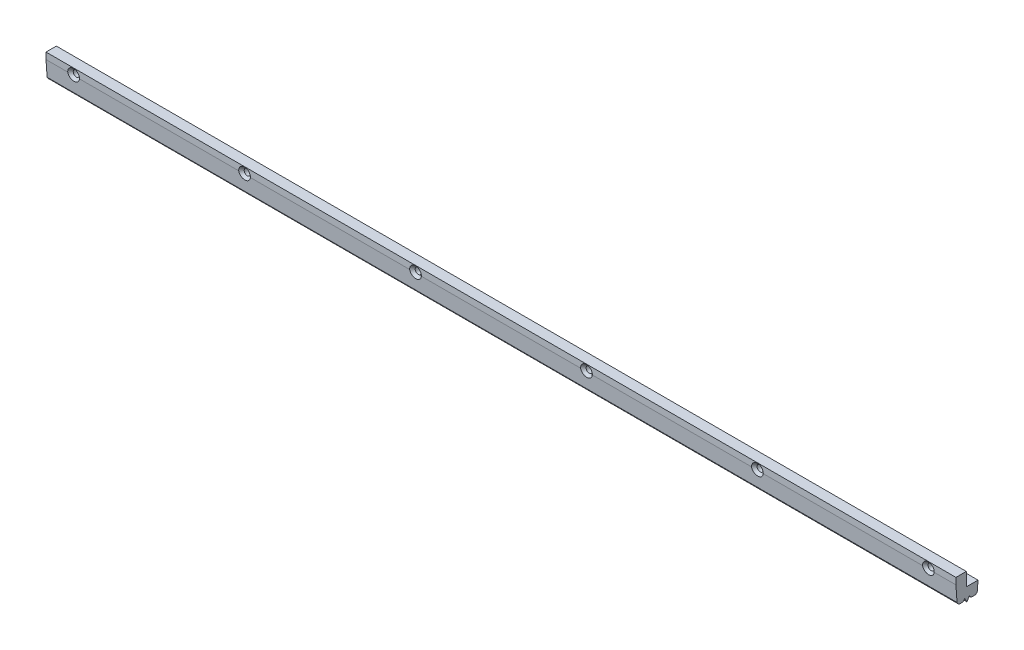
ISO-10303-21;
HEADER;
FILE_DESCRIPTION(('STEP AP214'),'2;1');
FILE_NAME('part.step','',(''),(''),'','','');
FILE_SCHEMA(('AUTOMOTIVE_DESIGN { 1 0 10303 214 1 1 1 1 }'));
ENDSEC;
DATA;
#1=APPLICATION_CONTEXT('core data for automotive mechanical design processes');
#2=APPLICATION_PROTOCOL_DEFINITION('international standard','automotive_design',2000,#1);
#3=PRODUCT_CONTEXT('',#1,'mechanical');
#4=PRODUCT('Part','Part','',(#3));
#5=PRODUCT_RELATED_PRODUCT_CATEGORY('part','',(#4));
#6=PRODUCT_DEFINITION_FORMATION('','',#4);
#7=PRODUCT_DEFINITION_CONTEXT('part definition',#1,'design');
#8=PRODUCT_DEFINITION('design','',#6,#7);
#9=PRODUCT_DEFINITION_SHAPE('','',#8);
#10=(LENGTH_UNIT() NAMED_UNIT(*) SI_UNIT(.MILLI.,.METRE.));
#11=(NAMED_UNIT(*) PLANE_ANGLE_UNIT() SI_UNIT($,.RADIAN.));
#12=(NAMED_UNIT(*) SI_UNIT($,.STERADIAN.) SOLID_ANGLE_UNIT());
#13=UNCERTAINTY_MEASURE_WITH_UNIT(LENGTH_MEASURE(1.E-05),#10,'distance_accuracy_value','');
#14=(GEOMETRIC_REPRESENTATION_CONTEXT(3) GLOBAL_UNCERTAINTY_ASSIGNED_CONTEXT((#13)) GLOBAL_UNIT_ASSIGNED_CONTEXT((#10,
#11,#12)) REPRESENTATION_CONTEXT('',''));
#15=CARTESIAN_POINT('',(0.,0.,0.));
#16=DIRECTION('',(0.,0.,1.));
#17=DIRECTION('',(1.,0.,0.));
#18=AXIS2_PLACEMENT_3D('',#15,#16,#17);
#19=CARTESIAN_POINT('',(330.,0.,0.));
#20=DIRECTION('',(0.,0.5,-0.866025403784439));
#21=DIRECTION('',(0.,0.866025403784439,0.5));
#22=AXIS2_PLACEMENT_3D('',#19,#20,#21);
#23=PLANE('',#22);
#24=DIRECTION('',(0.,-0.866025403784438,-0.5));
#25=VECTOR('',#24,1.);
#26=CARTESIAN_POINT('',(-330.,0.,0.));
#27=LINE('',#26,#25);
#28=CARTESIAN_POINT('',(-330.,3.03108891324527,1.74999999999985));
#29=VERTEX_POINT('',#28);
#30=CARTESIAN_POINT('',(-330.,0.,0.));
#31=VERTEX_POINT('',#30);
#32=EDGE_CURVE('E265',#29,#31,#27,.T.);
#33=ORIENTED_EDGE('',*,*,#32,.T.);
#34=DIRECTION('',(-1.,0.,0.));
#35=VECTOR('',#34,1.);
#36=CARTESIAN_POINT('',(330.,0.,0.));
#37=LINE('',#36,#35);
#38=CARTESIAN_POINT('',(330.,0.,0.));
#39=VERTEX_POINT('',#38);
#40=EDGE_CURVE('E252',#39,#31,#37,.T.);
#41=ORIENTED_EDGE('',*,*,#40,.F.);
#42=DIRECTION('',(0.,-0.866025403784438,-0.5));
#43=VECTOR('',#42,1.);
#44=CARTESIAN_POINT('',(330.,0.,0.));
#45=LINE('',#44,#43);
#46=CARTESIAN_POINT('',(330.,3.03108891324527,1.74999999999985));
#47=VERTEX_POINT('',#46);
#48=EDGE_CURVE('E381',#47,#39,#45,.T.);
#49=ORIENTED_EDGE('',*,*,#48,.F.);
#50=DIRECTION('',(-1.,0.,0.));
#51=VECTOR('',#50,1.);
#52=CARTESIAN_POINT('',(330.,3.03108891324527,1.74999999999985));
#53=LINE('',#52,#51);
#54=EDGE_CURVE('E430',#47,#29,#53,.T.);
#55=ORIENTED_EDGE('',*,*,#54,.T.);
#56=EDGE_LOOP('',(#33,#41,#49,#55));
#57=FACE_BOUND('',#56,.T.);
#58=ADVANCED_FACE('F40',(#57),#23,.F.);
#59=CARTESIAN_POINT('',(330.,0.,0.));
#60=DIRECTION('',(0.,0.499999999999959,0.866025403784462));
#61=DIRECTION('',(0.,-0.866025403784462,0.499999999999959));
#62=AXIS2_PLACEMENT_3D('',#59,#60,#61);
#63=PLANE('',#62);
#64=DIRECTION('',(0.,0.866025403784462,-0.499999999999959));
#65=VECTOR('',#64,1.);
#66=CARTESIAN_POINT('',(-330.,0.,0.));
#67=LINE('',#66,#65);
#68=CARTESIAN_POINT('',(-330.,3.03108891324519,-1.74999999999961));
#69=VERTEX_POINT('',#68);
#70=EDGE_CURVE('E339',#31,#69,#67,.T.);
#71=ORIENTED_EDGE('',*,*,#70,.T.);
#72=DIRECTION('',(-1.,0.,0.));
#73=VECTOR('',#72,1.);
#74=CARTESIAN_POINT('',(330.,3.03108891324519,-1.74999999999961));
#75=LINE('',#74,#73);
#76=CARTESIAN_POINT('',(330.,3.03108891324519,-1.74999999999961));
#77=VERTEX_POINT('',#76);
#78=EDGE_CURVE('E248',#77,#69,#75,.T.);
#79=ORIENTED_EDGE('',*,*,#78,.F.);
#80=DIRECTION('',(0.,0.866025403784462,-0.499999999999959));
#81=VECTOR('',#80,1.);
#82=CARTESIAN_POINT('',(330.,0.,0.));
#83=LINE('',#82,#81);
#84=EDGE_CURVE('E385',#39,#77,#83,.T.);
#85=ORIENTED_EDGE('',*,*,#84,.F.);
#86=ORIENTED_EDGE('',*,*,#40,.T.);
#87=EDGE_LOOP('',(#71,#79,#85,#86));
#88=FACE_BOUND('',#87,.T.);
#89=ADVANCED_FACE('F497',(#88),#63,.F.);
#90=CARTESIAN_POINT('',(330.,3.03108891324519,-1.74999999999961));
#91=DIRECTION('',(0.,0.500000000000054,-0.866025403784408));
#92=DIRECTION('',(0.,0.866025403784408,0.500000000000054));
#93=AXIS2_PLACEMENT_3D('',#90,#91,#92);
#94=PLANE('',#93);
#95=DIRECTION('',(0.,-0.866025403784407,-0.500000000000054));
#96=VECTOR('',#95,1.);
#97=CARTESIAN_POINT('',(-330.,3.03108891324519,-1.74999999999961));
#98=LINE('',#97,#96);
#99=CARTESIAN_POINT('',(-330.,1.89999999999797,-2.40303448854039));
#100=VERTEX_POINT('',#99);
#101=EDGE_CURVE('E342',#69,#100,#98,.T.);
#102=ORIENTED_EDGE('',*,*,#101,.T.);
#103=DIRECTION('',(-1.,0.,0.));
#104=VECTOR('',#103,1.);
#105=CARTESIAN_POINT('',(330.,1.89999999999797,-2.40303448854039));
#106=LINE('',#105,#104);
#107=CARTESIAN_POINT('',(330.,1.89999999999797,-2.40303448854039));
#108=VERTEX_POINT('',#107);
#109=EDGE_CURVE('E244',#108,#100,#106,.T.);
#110=ORIENTED_EDGE('',*,*,#109,.F.);
#111=DIRECTION('',(0.,-0.866025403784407,-0.500000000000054));
#112=VECTOR('',#111,1.);
#113=CARTESIAN_POINT('',(330.,3.03108891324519,-1.74999999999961));
#114=LINE('',#113,#112);
#115=EDGE_CURVE('E388',#77,#108,#114,.T.);
#116=ORIENTED_EDGE('',*,*,#115,.F.);
#117=ORIENTED_EDGE('',*,*,#78,.T.);
#118=EDGE_LOOP('',(#102,#110,#116,#117));
#119=FACE_BOUND('',#118,.T.);
#120=ADVANCED_FACE('F502',(#119),#94,.F.);
#121=CARTESIAN_POINT('',(330.,2.39999999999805,-3.2690598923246));
#122=DIRECTION('',(-1.,0.,0.));
#123=DIRECTION('',(0.,0.,1.));
#124=AXIS2_PLACEMENT_3D('',#121,#122,#123);
#125=CYLINDRICAL_SURFACE('',#124,0.999999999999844);
#126=CARTESIAN_POINT('',(-330.,2.39999999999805,-3.2690598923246));
#127=DIRECTION('',(1.,0.,0.));
#128=DIRECTION('',(0.,0.,-1.));
#129=AXIS2_PLACEMENT_3D('',#126,#127,#128);
#130=CIRCLE('',#129,0.999999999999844);
#131=CARTESIAN_POINT('',(-330.,1.3999999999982,-3.26905989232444));
#132=VERTEX_POINT('',#131);
#133=EDGE_CURVE('E345',#100,#132,#130,.T.);
#134=ORIENTED_EDGE('',*,*,#133,.T.);
#135=DIRECTION('',(-1.,0.,0.));
#136=VECTOR('',#135,1.);
#137=CARTESIAN_POINT('',(330.,1.3999999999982,-3.26905989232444));
#138=LINE('',#137,#136);
#139=CARTESIAN_POINT('',(330.,1.3999999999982,-3.26905989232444));
#140=VERTEX_POINT('',#139);
#141=EDGE_CURVE('E240',#140,#132,#138,.T.);
#142=ORIENTED_EDGE('',*,*,#141,.F.);
#143=CARTESIAN_POINT('',(330.,2.39999999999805,-3.2690598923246));
#144=DIRECTION('',(1.,0.,0.));
#145=DIRECTION('',(0.,0.,-1.));
#146=AXIS2_PLACEMENT_3D('',#143,#144,#145);
#147=CIRCLE('',#146,0.999999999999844);
#148=EDGE_CURVE('E391',#108,#140,#147,.T.);
#149=ORIENTED_EDGE('',*,*,#148,.F.);
#150=ORIENTED_EDGE('',*,*,#109,.T.);
#151=EDGE_LOOP('',(#134,#142,#149,#150));
#152=FACE_BOUND('',#151,.T.);
#153=ADVANCED_FACE('F515',(#152),#125,.T.);
#154=CARTESIAN_POINT('',(330.,1.3999999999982,-3.26905989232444));
#155=DIRECTION('',(0.,1.,0.));
#156=DIRECTION('',(0.,0.,1.));
#157=AXIS2_PLACEMENT_3D('',#154,#155,#156);
#158=PLANE('',#157);
#159=DIRECTION('',(0.,0.,-1.));
#160=VECTOR('',#159,1.);
#161=CARTESIAN_POINT('',(-330.,1.3999999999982,-3.26905989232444));
#162=LINE('',#161,#160);
#163=CARTESIAN_POINT('',(-330.,1.3999999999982,-5.55457728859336));
#164=VERTEX_POINT('',#163);
#165=EDGE_CURVE('E348',#132,#164,#162,.T.);
#166=ORIENTED_EDGE('',*,*,#165,.T.);
#167=DIRECTION('',(-1.,0.,0.));
#168=VECTOR('',#167,1.);
#169=CARTESIAN_POINT('',(330.,1.3999999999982,-5.55457728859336));
#170=LINE('',#169,#168);
#171=CARTESIAN_POINT('',(330.,1.3999999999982,-5.55457728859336));
#172=VERTEX_POINT('',#171);
#173=EDGE_CURVE('E236',#172,#164,#170,.T.);
#174=ORIENTED_EDGE('',*,*,#173,.F.);
#175=DIRECTION('',(0.,0.,-1.));
#176=VECTOR('',#175,1.);
#177=CARTESIAN_POINT('',(330.,1.3999999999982,-3.26905989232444));
#178=LINE('',#177,#176);
#179=EDGE_CURVE('E394',#140,#172,#178,.T.);
#180=ORIENTED_EDGE('',*,*,#179,.F.);
#181=ORIENTED_EDGE('',*,*,#141,.T.);
#182=EDGE_LOOP('',(#166,#174,#180,#181));
#183=FACE_BOUND('',#182,.T.);
#184=ADVANCED_FACE('F520',(#183),#158,.F.);
#185=CARTESIAN_POINT('',(330.,3.39999999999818,-5.55457728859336));
#186=DIRECTION('',(-1.,0.,0.));
#187=DIRECTION('',(0.,0.,1.));
#188=AXIS2_PLACEMENT_3D('',#185,#186,#187);
#189=CYLINDRICAL_SURFACE('',#188,1.99999999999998);
#190=CARTESIAN_POINT('',(-330.,3.39999999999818,-5.55457728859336));
#191=DIRECTION('',(1.,0.,0.));
#192=DIRECTION('',(0.,0.,-1.));
#193=AXIS2_PLACEMENT_3D('',#190,#191,#192);
#194=CIRCLE('',#193,1.99999999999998);
#195=CARTESIAN_POINT('',(-330.,3.26048705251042,-7.54970538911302));
#196=VERTEX_POINT('',#195);
#197=EDGE_CURVE('E351',#164,#196,#194,.T.);
#198=ORIENTED_EDGE('',*,*,#197,.T.);
#199=DIRECTION('',(-1.,0.,0.));
#200=VECTOR('',#199,1.);
#201=CARTESIAN_POINT('',(330.,3.26048705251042,-7.54970538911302));
#202=LINE('',#201,#200);
#203=CARTESIAN_POINT('',(330.,3.26048705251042,-7.54970538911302));
#204=VERTEX_POINT('',#203);
#205=EDGE_CURVE('E232',#204,#196,#202,.T.);
#206=ORIENTED_EDGE('',*,*,#205,.F.);
#207=CARTESIAN_POINT('',(330.,3.39999999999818,-5.55457728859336));
#208=DIRECTION('',(1.,0.,0.));
#209=DIRECTION('',(0.,0.,-1.));
#210=AXIS2_PLACEMENT_3D('',#207,#208,#209);
#211=CIRCLE('',#210,1.99999999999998);
#212=EDGE_CURVE('E397',#172,#204,#211,.T.);
#213=ORIENTED_EDGE('',*,*,#212,.F.);
#214=ORIENTED_EDGE('',*,*,#173,.T.);
#215=EDGE_LOOP('',(#198,#206,#213,#214));
#216=FACE_BOUND('',#215,.T.);
#217=ADVANCED_FACE('F526',(#216),#189,.T.);
#218=CARTESIAN_POINT('',(330.,9.69999999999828,-7.999999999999));
#219=DIRECTION('',(0.,0.069756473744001,0.997564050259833));
#220=DIRECTION('',(0.,-0.997564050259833,0.069756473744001));
#221=AXIS2_PLACEMENT_3D('',#218,#219,#220);
#222=PLANE('',#221);
#223=DIRECTION('',(0.,0.997564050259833,-0.069756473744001));
#224=VECTOR('',#223,1.);
#225=CARTESIAN_POINT('',(-330.,9.69999999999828,-7.999999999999));
#226=LINE('',#225,#224);
#227=CARTESIAN_POINT('',(-330.,9.69999999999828,-7.999999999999));
#228=VERTEX_POINT('',#227);
#229=EDGE_CURVE('E354',#196,#228,#226,.T.);
#230=ORIENTED_EDGE('',*,*,#229,.T.);
#231=DIRECTION('',(-1.,0.,0.));
#232=VECTOR('',#231,1.);
#233=CARTESIAN_POINT('',(330.,9.69999999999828,-7.999999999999));
#234=LINE('',#233,#232);
#235=CARTESIAN_POINT('',(330.,9.69999999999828,-7.999999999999));
#236=VERTEX_POINT('',#235);
#237=EDGE_CURVE('E228',#236,#228,#234,.T.);
#238=ORIENTED_EDGE('',*,*,#237,.F.);
#239=DIRECTION('',(0.,0.997564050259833,-0.069756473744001));
#240=VECTOR('',#239,1.);
#241=CARTESIAN_POINT('',(330.,9.69999999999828,-7.999999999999));
#242=LINE('',#241,#240);
#243=EDGE_CURVE('E400',#204,#236,#242,.T.);
#244=ORIENTED_EDGE('',*,*,#243,.F.);
#245=ORIENTED_EDGE('',*,*,#205,.T.);
#246=EDGE_LOOP('',(#230,#238,#244,#245));
#247=FACE_BOUND('',#246,.T.);
#248=ADVANCED_FACE('F530',(#247),#222,.F.);
#249=CARTESIAN_POINT('',(330.,9.69999999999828,-7.999999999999));
#250=DIRECTION('',(0.,-1.,0.));
#251=DIRECTION('',(0.,0.,-1.));
#252=AXIS2_PLACEMENT_3D('',#249,#250,#251);
#253=PLANE('',#252);
#254=DIRECTION('',(0.,0.,1.));
#255=VECTOR('',#254,1.);
#256=CARTESIAN_POINT('',(-330.,9.69999999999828,-7.999999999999));
#257=LINE('',#256,#255);
#258=CARTESIAN_POINT('',(-330.,9.69999999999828,0.500000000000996));
#259=VERTEX_POINT('',#258);
#260=EDGE_CURVE('E356',#228,#259,#257,.T.);
#261=ORIENTED_EDGE('',*,*,#260,.T.);
#262=DIRECTION('',(-1.,0.,0.));
#263=VECTOR('',#262,1.);
#264=CARTESIAN_POINT('',(330.,9.69999999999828,0.500000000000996));
#265=LINE('',#264,#263);
#266=CARTESIAN_POINT('',(330.,9.69999999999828,0.500000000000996));
#267=VERTEX_POINT('',#266);
#268=EDGE_CURVE('E224',#267,#259,#265,.T.);
#269=ORIENTED_EDGE('',*,*,#268,.F.);
#270=DIRECTION('',(0.,0.,1.));
#271=VECTOR('',#270,1.);
#272=CARTESIAN_POINT('',(330.,9.69999999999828,-7.999999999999));
#273=LINE('',#272,#271);
#274=EDGE_CURVE('E403',#236,#267,#273,.T.);
#275=ORIENTED_EDGE('',*,*,#274,.F.);
#276=ORIENTED_EDGE('',*,*,#237,.T.);
#277=EDGE_LOOP('',(#261,#269,#275,#276));
#278=FACE_BOUND('',#277,.T.);
#279=ADVANCED_FACE('F535',(#278),#253,.F.);
#280=CARTESIAN_POINT('',(330.,19.3999999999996,0.500000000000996));
#281=DIRECTION('',(0.,0.,1.));
#282=DIRECTION('',(1.,0.,0.));
#283=AXIS2_PLACEMENT_3D('',#280,#281,#282);
#284=PLANE('',#283);
#285=CARTESIAN_POINT('',(-310.,14.8999999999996,0.500000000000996));
#286=DIRECTION('',(0.,0.,1.));
#287=DIRECTION('',(1.,0.,0.));
#288=AXIS2_PLACEMENT_3D('',#285,#286,#287);
#289=CIRCLE('',#288,2.24999999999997);
#290=CARTESIAN_POINT('',(-307.75,14.8999999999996,0.500000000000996));
#291=VERTEX_POINT('',#290);
#292=EDGE_CURVE('E43',#291,#291,#289,.T.);
#293=ORIENTED_EDGE('',*,*,#292,.T.);
#294=EDGE_LOOP('',(#293));
#295=FACE_BOUND('',#294,.T.);
#296=CARTESIAN_POINT('',(-186.,14.8999999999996,0.500000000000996));
#297=DIRECTION('',(0.,0.,1.));
#298=DIRECTION('',(1.,0.,0.));
#299=AXIS2_PLACEMENT_3D('',#296,#297,#298);
#300=CIRCLE('',#299,2.25);
#301=CARTESIAN_POINT('',(-183.75,14.8999999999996,0.500000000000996));
#302=VERTEX_POINT('',#301);
#303=EDGE_CURVE('E298',#302,#302,#300,.T.);
#304=ORIENTED_EDGE('',*,*,#303,.T.);
#305=EDGE_LOOP('',(#304));
#306=FACE_BOUND('',#305,.T.);
#307=CARTESIAN_POINT('',(-62.,14.8999999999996,0.500000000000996));
#308=DIRECTION('',(0.,0.,1.));
#309=DIRECTION('',(1.,0.,0.));
#310=AXIS2_PLACEMENT_3D('',#307,#308,#309);
#311=CIRCLE('',#310,2.25);
#312=CARTESIAN_POINT('',(-59.75,14.8999999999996,0.500000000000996));
#313=VERTEX_POINT('',#312);
#314=EDGE_CURVE('E290',#313,#313,#311,.T.);
#315=ORIENTED_EDGE('',*,*,#314,.T.);
#316=EDGE_LOOP('',(#315));
#317=FACE_BOUND('',#316,.T.);
#318=CARTESIAN_POINT('',(62.,14.8999999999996,0.500000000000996));
#319=DIRECTION('',(0.,0.,1.));
#320=DIRECTION('',(1.,0.,0.));
#321=AXIS2_PLACEMENT_3D('',#318,#319,#320);
#322=CIRCLE('',#321,2.25);
#323=CARTESIAN_POINT('',(64.25,14.8999999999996,0.500000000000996));
#324=VERTEX_POINT('',#323);
#325=EDGE_CURVE('E281',#324,#324,#322,.T.);
#326=ORIENTED_EDGE('',*,*,#325,.T.);
#327=EDGE_LOOP('',(#326));
#328=FACE_BOUND('',#327,.T.);
#329=CARTESIAN_POINT('',(186.,14.8999999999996,0.500000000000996));
#330=DIRECTION('',(0.,0.,1.));
#331=DIRECTION('',(1.,0.,0.));
#332=AXIS2_PLACEMENT_3D('',#329,#330,#331);
#333=CIRCLE('',#332,2.25);
#334=CARTESIAN_POINT('',(188.25,14.8999999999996,0.500000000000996));
#335=VERTEX_POINT('',#334);
#336=EDGE_CURVE('E271',#335,#335,#333,.T.);
#337=ORIENTED_EDGE('',*,*,#336,.T.);
#338=EDGE_LOOP('',(#337));
#339=FACE_BOUND('',#338,.T.);
#340=CARTESIAN_POINT('',(310.,14.8999999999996,0.500000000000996));
#341=DIRECTION('',(0.,0.,1.));
#342=DIRECTION('',(1.,0.,0.));
#343=AXIS2_PLACEMENT_3D('',#340,#341,#342);
#344=CIRCLE('',#343,2.24999999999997);
#345=CARTESIAN_POINT('',(312.25,14.8999999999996,0.500000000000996));
#346=VERTEX_POINT('',#345);
#347=EDGE_CURVE('E261',#346,#346,#344,.T.);
#348=ORIENTED_EDGE('',*,*,#347,.T.);
#349=EDGE_LOOP('',(#348));
#350=FACE_BOUND('',#349,.T.);
#351=DIRECTION('',(0.,1.,0.));
#352=VECTOR('',#351,1.);
#353=CARTESIAN_POINT('',(-330.,19.3999999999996,0.500000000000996));
#354=LINE('',#353,#352);
#355=CARTESIAN_POINT('',(-330.,19.3999999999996,0.500000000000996));
#356=VERTEX_POINT('',#355);
#357=EDGE_CURVE('E358',#259,#356,#354,.T.);
#358=ORIENTED_EDGE('',*,*,#357,.T.);
#359=DIRECTION('',(-1.,0.,0.));
#360=VECTOR('',#359,1.);
#361=CARTESIAN_POINT('',(330.,19.3999999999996,0.500000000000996));
#362=LINE('',#361,#360);
#363=CARTESIAN_POINT('',(330.,19.3999999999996,0.500000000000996));
#364=VERTEX_POINT('',#363);
#365=EDGE_CURVE('E221',#364,#356,#362,.T.);
#366=ORIENTED_EDGE('',*,*,#365,.F.);
#367=DIRECTION('',(0.,1.,0.));
#368=VECTOR('',#367,1.);
#369=CARTESIAN_POINT('',(330.,19.3999999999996,0.500000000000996));
#370=LINE('',#369,#368);
#371=EDGE_CURVE('E406',#267,#364,#370,.T.);
#372=ORIENTED_EDGE('',*,*,#371,.F.);
#373=ORIENTED_EDGE('',*,*,#268,.T.);
#374=EDGE_LOOP('',(#358,#366,#372,#373));
#375=FACE_BOUND('',#374,.T.);
#376=ADVANCED_FACE('F541',(#295,#306,#317,#328,#339,#350,#375),#284,.F.);
#377=CARTESIAN_POINT('',(330.,19.3999999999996,0.500000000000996));
#378=DIRECTION('',(0.,-1.,0.));
#379=DIRECTION('',(0.,0.,-1.));
#380=AXIS2_PLACEMENT_3D('',#377,#378,#379);
#381=PLANE('',#380);
#382=DIRECTION('',(0.,0.,1.));
#383=VECTOR('',#382,1.);
#384=CARTESIAN_POINT('',(-330.,19.3999999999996,0.500000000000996));
#385=LINE('',#384,#383);
#386=CARTESIAN_POINT('',(-330.,19.3999999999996,8.00000000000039));
#387=VERTEX_POINT('',#386);
#388=EDGE_CURVE('E361',#356,#387,#385,.T.);
#389=ORIENTED_EDGE('',*,*,#388,.T.);
#390=DIRECTION('',(-1.,0.,0.));
#391=VECTOR('',#390,1.);
#392=CARTESIAN_POINT('',(330.,19.3999999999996,8.00000000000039));
#393=LINE('',#392,#391);
#394=CARTESIAN_POINT('',(330.,19.3999999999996,8.00000000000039));
#395=VERTEX_POINT('',#394);
#396=EDGE_CURVE('E215',#395,#387,#393,.T.);
#397=ORIENTED_EDGE('',*,*,#396,.F.);
#398=DIRECTION('',(0.,0.,1.));
#399=VECTOR('',#398,1.);
#400=CARTESIAN_POINT('',(330.,19.3999999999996,0.500000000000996));
#401=LINE('',#400,#399);
#402=EDGE_CURVE('E409',#364,#395,#401,.T.);
#403=ORIENTED_EDGE('',*,*,#402,.F.);
#404=ORIENTED_EDGE('',*,*,#365,.T.);
#405=EDGE_LOOP('',(#389,#397,#403,#404));
#406=FACE_BOUND('',#405,.T.);
#407=ADVANCED_FACE('F545',(#406),#381,.F.);
#408=CARTESIAN_POINT('',(330.,19.3999999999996,8.00000000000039));
#409=DIRECTION('',(0.,0.,-1.));
#410=DIRECTION('',(-1.,0.,0.));
#411=AXIS2_PLACEMENT_3D('',#408,#409,#410);
#412=PLANE('',#411);
#413=DIRECTION('',(-1.,0.,0.));
#414=VECTOR('',#413,1.);
#415=CARTESIAN_POINT('',(330.,14.6999999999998,8.00000000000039));
#416=LINE('',#415,#414);
#417=CARTESIAN_POINT('',(-314.245291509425,14.6999999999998,8.00000000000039));
#418=VERTEX_POINT('',#417);
#419=CARTESIAN_POINT('',(-330.,14.6999999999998,8.00000000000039));
#420=VERTEX_POINT('',#419);
#421=EDGE_CURVE('E195',#418,#420,#416,.T.);
#422=ORIENTED_EDGE('',*,*,#421,.F.);
#423=CARTESIAN_POINT('',(-310.,14.8999999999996,8.00000000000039));
#424=DIRECTION('',(0.,0.,1.));
#425=DIRECTION('',(1.,0.,0.));
#426=AXIS2_PLACEMENT_3D('',#423,#424,#425);
#427=CIRCLE('',#426,4.24999999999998);
#428=CARTESIAN_POINT('',(-305.754708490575,14.6999999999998,8.00000000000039));
#429=VERTEX_POINT('',#428);
#430=EDGE_CURVE('E55',#429,#418,#427,.T.);
#431=ORIENTED_EDGE('',*,*,#430,.F.);
#432=CARTESIAN_POINT('',(-190.245291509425,14.6999999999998,8.00000000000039));
#433=VERTEX_POINT('',#432);
#434=EDGE_CURVE('E193',#433,#429,#416,.T.);
#435=ORIENTED_EDGE('',*,*,#434,.F.);
#436=CARTESIAN_POINT('',(-186.,14.8999999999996,8.00000000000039));
#437=DIRECTION('',(0.,0.,1.));
#438=DIRECTION('',(1.,0.,0.));
#439=AXIS2_PLACEMENT_3D('',#436,#437,#438);
#440=CIRCLE('',#439,4.25);
#441=CARTESIAN_POINT('',(-181.754708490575,14.6999999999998,8.00000000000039));
#442=VERTEX_POINT('',#441);
#443=EDGE_CURVE('E61',#442,#433,#440,.T.);
#444=ORIENTED_EDGE('',*,*,#443,.F.);
#445=CARTESIAN_POINT('',(-66.2452915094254,14.6999999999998,8.00000000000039));
#446=VERTEX_POINT('',#445);
#447=EDGE_CURVE('E202',#446,#442,#416,.T.);
#448=ORIENTED_EDGE('',*,*,#447,.F.);
#449=CARTESIAN_POINT('',(-62.,14.8999999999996,8.00000000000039));
#450=DIRECTION('',(0.,0.,1.));
#451=DIRECTION('',(1.,0.,0.));
#452=AXIS2_PLACEMENT_3D('',#449,#450,#451);
#453=CIRCLE('',#452,4.25);
#454=CARTESIAN_POINT('',(-57.7547084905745,14.6999999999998,8.00000000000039));
#455=VERTEX_POINT('',#454);
#456=EDGE_CURVE('E301',#455,#446,#453,.T.);
#457=ORIENTED_EDGE('',*,*,#456,.F.);
#458=CARTESIAN_POINT('',(57.7547084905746,14.6999999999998,8.00000000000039));
#459=VERTEX_POINT('',#458);
#460=EDGE_CURVE('E207',#459,#455,#416,.T.);
#461=ORIENTED_EDGE('',*,*,#460,.F.);
#462=CARTESIAN_POINT('',(62.,14.8999999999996,8.00000000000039));
#463=DIRECTION('',(0.,0.,1.));
#464=DIRECTION('',(1.,0.,0.));
#465=AXIS2_PLACEMENT_3D('',#462,#463,#464);
#466=CIRCLE('',#465,4.25);
#467=CARTESIAN_POINT('',(66.2452915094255,14.6999999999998,8.00000000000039));
#468=VERTEX_POINT('',#467);
#469=EDGE_CURVE('E294',#468,#459,#466,.T.);
#470=ORIENTED_EDGE('',*,*,#469,.F.);
#471=CARTESIAN_POINT('',(181.754708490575,14.6999999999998,8.00000000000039));
#472=VERTEX_POINT('',#471);
#473=EDGE_CURVE('E840',#472,#468,#416,.T.);
#474=ORIENTED_EDGE('',*,*,#473,.F.);
#475=CARTESIAN_POINT('',(186.,14.8999999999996,8.00000000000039));
#476=DIRECTION('',(0.,0.,1.));
#477=DIRECTION('',(1.,0.,0.));
#478=AXIS2_PLACEMENT_3D('',#475,#476,#477);
#479=CIRCLE('',#478,4.25);
#480=CARTESIAN_POINT('',(190.245291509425,14.6999999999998,8.00000000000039));
#481=VERTEX_POINT('',#480);
#482=EDGE_CURVE('E285',#481,#472,#479,.T.);
#483=ORIENTED_EDGE('',*,*,#482,.F.);
#484=CARTESIAN_POINT('',(305.754708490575,14.6999999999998,8.00000000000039));
#485=VERTEX_POINT('',#484);
#486=EDGE_CURVE('E216',#485,#481,#416,.T.);
#487=ORIENTED_EDGE('',*,*,#486,.F.);
#488=CARTESIAN_POINT('',(310.,14.8999999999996,8.00000000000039));
#489=DIRECTION('',(0.,0.,1.));
#490=DIRECTION('',(1.,0.,0.));
#491=AXIS2_PLACEMENT_3D('',#488,#489,#490);
#492=CIRCLE('',#491,4.24999999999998);
#493=CARTESIAN_POINT('',(314.245291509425,14.6999999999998,8.00000000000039));
#494=VERTEX_POINT('',#493);
#495=EDGE_CURVE('E275',#494,#485,#492,.T.);
#496=ORIENTED_EDGE('',*,*,#495,.F.);
#497=CARTESIAN_POINT('',(330.,14.6999999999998,8.00000000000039));
#498=VERTEX_POINT('',#497);
#499=EDGE_CURVE('E210',#498,#494,#416,.T.);
#500=ORIENTED_EDGE('',*,*,#499,.F.);
#501=DIRECTION('',(0.,-1.,0.));
#502=VECTOR('',#501,1.);
#503=CARTESIAN_POINT('',(330.,19.3999999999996,8.00000000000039));
#504=LINE('',#503,#502);
#505=EDGE_CURVE('E412',#395,#498,#504,.T.);
#506=ORIENTED_EDGE('',*,*,#505,.F.);
#507=ORIENTED_EDGE('',*,*,#396,.T.);
#508=DIRECTION('',(0.,-1.,0.));
#509=VECTOR('',#508,1.);
#510=CARTESIAN_POINT('',(-330.,19.3999999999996,8.00000000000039));
#511=LINE('',#510,#509);
#512=EDGE_CURVE('E363',#387,#420,#511,.T.);
#513=ORIENTED_EDGE('',*,*,#512,.T.);
#514=EDGE_LOOP('',(#422,#431,#435,#444,#448,#457,#461,#470,#474,#483,#487,#496,#500,#506,#507,#513));
#515=FACE_BOUND('',#514,.T.);
#516=ADVANCED_FACE('F192',(#515),#412,.F.);
#517=CARTESIAN_POINT('',(330.,14.6999999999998,8.00000000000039));
#518=DIRECTION('',(0.,0.0697564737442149,-0.997564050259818));
#519=DIRECTION('',(0.,0.997564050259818,0.0697564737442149));
#520=AXIS2_PLACEMENT_3D('',#517,#518,#519);
#521=PLANE('',#520);
#522=ORIENTED_EDGE('',*,*,#434,.T.);
#523=CARTESIAN_POINT('',(-310.,15.1996320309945,8.03493767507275));
#524=DIRECTION('',(0.,0.0697564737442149,-0.997564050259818));
#525=DIRECTION('',(0.,0.997564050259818,0.0697564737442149));
#526=AXIS2_PLACEMENT_3D('',#523,#524,#525);
#527=ELLIPSE('',#526,4.29540105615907,4.2744486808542);
#528=EDGE_CURVE('E11',#429,#418,#527,.T.);
#529=ORIENTED_EDGE('',*,*,#528,.T.);
#530=ORIENTED_EDGE('',*,*,#421,.T.);
#531=DIRECTION('',(0.,-0.997564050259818,-0.0697564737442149));
#532=VECTOR('',#531,1.);
#533=CARTESIAN_POINT('',(-330.,14.6999999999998,8.00000000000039));
#534=LINE('',#533,#532);
#535=CARTESIAN_POINT('',(-330.,3.26048705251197,7.20007132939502));
#536=VERTEX_POINT('',#535);
#537=EDGE_CURVE('E366',#420,#536,#534,.T.);
#538=ORIENTED_EDGE('',*,*,#537,.T.);
#539=DIRECTION('',(-1.,0.,0.));
#540=VECTOR('',#539,1.);
#541=CARTESIAN_POINT('',(330.,3.26048705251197,7.20007132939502));
#542=LINE('',#541,#540);
#543=CARTESIAN_POINT('',(330.,3.26048705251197,7.20007132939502));
#544=VERTEX_POINT('',#543);
#545=EDGE_CURVE('E209',#544,#536,#542,.T.);
#546=ORIENTED_EDGE('',*,*,#545,.F.);
#547=DIRECTION('',(0.,-0.997564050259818,-0.0697564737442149));
#548=VECTOR('',#547,1.);
#549=CARTESIAN_POINT('',(330.,14.6999999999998,8.00000000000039));
#550=LINE('',#549,#548);
#551=EDGE_CURVE('E415',#498,#544,#550,.T.);
#552=ORIENTED_EDGE('',*,*,#551,.F.);
#553=ORIENTED_EDGE('',*,*,#499,.T.);
#554=CARTESIAN_POINT('',(310.,15.1996320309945,8.03493767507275));
#555=DIRECTION('',(0.,0.0697564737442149,-0.997564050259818));
#556=DIRECTION('',(0.,0.997564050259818,0.0697564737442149));
#557=AXIS2_PLACEMENT_3D('',#554,#555,#556);
#558=ELLIPSE('',#557,4.29540105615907,4.2744486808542);
#559=EDGE_CURVE('E256',#494,#485,#558,.T.);
#560=ORIENTED_EDGE('',*,*,#559,.T.);
#561=ORIENTED_EDGE('',*,*,#486,.T.);
#562=CARTESIAN_POINT('',(186.,15.1996320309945,8.03493767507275));
#563=DIRECTION('',(0.,0.0697564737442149,-0.997564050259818));
#564=DIRECTION('',(0.,0.997564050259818,0.0697564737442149));
#565=AXIS2_PLACEMENT_3D('',#562,#563,#564);
#566=ELLIPSE('',#565,4.29540105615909,4.27444868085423);
#567=EDGE_CURVE('E260',#481,#472,#566,.T.);
#568=ORIENTED_EDGE('',*,*,#567,.T.);
#569=ORIENTED_EDGE('',*,*,#473,.T.);
#570=CARTESIAN_POINT('',(62.,15.1996320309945,8.03493767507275));
#571=DIRECTION('',(0.,0.0697564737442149,-0.997564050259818));
#572=DIRECTION('',(0.,0.997564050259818,0.0697564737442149));
#573=AXIS2_PLACEMENT_3D('',#570,#571,#572);
#574=ELLIPSE('',#573,4.29540105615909,4.27444868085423);
#575=EDGE_CURVE('E270',#468,#459,#574,.T.);
#576=ORIENTED_EDGE('',*,*,#575,.T.);
#577=ORIENTED_EDGE('',*,*,#460,.T.);
#578=CARTESIAN_POINT('',(-62.,15.1996320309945,8.03493767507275));
#579=DIRECTION('',(0.,0.0697564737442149,-0.997564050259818));
#580=DIRECTION('',(0.,0.997564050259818,0.0697564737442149));
#581=AXIS2_PLACEMENT_3D('',#578,#579,#580);
#582=ELLIPSE('',#581,4.2954010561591,4.27444868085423);
#583=EDGE_CURVE('E280',#455,#446,#582,.T.);
#584=ORIENTED_EDGE('',*,*,#583,.T.);
#585=ORIENTED_EDGE('',*,*,#447,.T.);
#586=CARTESIAN_POINT('',(-186.,15.1996320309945,8.03493767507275));
#587=DIRECTION('',(0.,0.0697564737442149,-0.997564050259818));
#588=DIRECTION('',(0.,0.997564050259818,0.0697564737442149));
#589=AXIS2_PLACEMENT_3D('',#586,#587,#588);
#590=ELLIPSE('',#589,4.29540105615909,4.27444868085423);
#591=EDGE_CURVE('E49',#442,#433,#590,.T.);
#592=ORIENTED_EDGE('',*,*,#591,.T.);
#593=EDGE_LOOP('',(#522,#529,#530,#538,#546,#552,#553,#560,#561,#568,#569,#576,#577,#584,#585,#592));
#594=FACE_BOUND('',#593,.T.);
#595=ADVANCED_FACE('F199',(#594),#521,.F.);
#596=CARTESIAN_POINT('',(330.,3.92158707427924,4.76592528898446));
#597=DIRECTION('',(-1.,0.,0.));
#598=DIRECTION('',(0.,0.,1.));
#599=AXIS2_PLACEMENT_3D('',#596,#597,#598);
#600=CYLINDRICAL_SURFACE('',#599,2.52232436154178);
#601=CARTESIAN_POINT('',(-330.,3.92158707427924,4.76592528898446));
#602=DIRECTION('',(1.,0.,0.));
#603=DIRECTION('',(0.,0.,-1.));
#604=AXIS2_PLACEMENT_3D('',#601,#602,#603);
#605=CIRCLE('',#604,2.52232436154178);
#606=CARTESIAN_POINT('',(-330.,1.40000000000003,4.70494322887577));
#607=VERTEX_POINT('',#606);
#608=EDGE_CURVE('E369',#536,#607,#605,.T.);
#609=ORIENTED_EDGE('',*,*,#608,.T.);
#610=DIRECTION('',(-1.,0.,0.));
#611=VECTOR('',#610,1.);
#612=CARTESIAN_POINT('',(330.,1.40000000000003,4.70494322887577));
#613=LINE('',#612,#611);
#614=CARTESIAN_POINT('',(330.,1.40000000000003,4.70494322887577));
#615=VERTEX_POINT('',#614);
#616=EDGE_CURVE('E441',#615,#607,#613,.T.);
#617=ORIENTED_EDGE('',*,*,#616,.F.);
#618=CARTESIAN_POINT('',(330.,3.92158707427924,4.76592528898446));
#619=DIRECTION('',(1.,0.,0.));
#620=DIRECTION('',(0.,0.,-1.));
#621=AXIS2_PLACEMENT_3D('',#618,#619,#620);
#622=CIRCLE('',#621,2.52232436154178);
#623=EDGE_CURVE('E418',#544,#615,#622,.T.);
#624=ORIENTED_EDGE('',*,*,#623,.F.);
#625=ORIENTED_EDGE('',*,*,#545,.T.);
#626=EDGE_LOOP('',(#609,#617,#624,#625));
#627=FACE_BOUND('',#626,.T.);
#628=ADVANCED_FACE('F454',(#627),#600,.T.);
#629=CARTESIAN_POINT('',(330.,1.40000000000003,3.26905989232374));
#630=DIRECTION('',(0.,1.,0.));
#631=DIRECTION('',(0.,0.,1.));
#632=AXIS2_PLACEMENT_3D('',#629,#630,#631);
#633=PLANE('',#632);
#634=DIRECTION('',(0.,0.,-1.));
#635=VECTOR('',#634,1.);
#636=CARTESIAN_POINT('',(-330.,1.40000000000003,3.26905989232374));
#637=LINE('',#636,#635);
#638=CARTESIAN_POINT('',(-330.,1.40000000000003,3.26905989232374));
#639=VERTEX_POINT('',#638);
#640=EDGE_CURVE('E372',#607,#639,#637,.T.);
#641=ORIENTED_EDGE('',*,*,#640,.T.);
#642=DIRECTION('',(-1.,0.,0.));
#643=VECTOR('',#642,1.);
#644=CARTESIAN_POINT('',(330.,1.40000000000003,3.26905989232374));
#645=LINE('',#644,#643);
#646=CARTESIAN_POINT('',(330.,1.40000000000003,3.26905989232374));
#647=VERTEX_POINT('',#646);
#648=EDGE_CURVE('E438',#647,#639,#645,.T.);
#649=ORIENTED_EDGE('',*,*,#648,.F.);
#650=DIRECTION('',(0.,0.,-1.));
#651=VECTOR('',#650,1.);
#652=CARTESIAN_POINT('',(330.,1.40000000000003,3.26905989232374));
#653=LINE('',#652,#651);
#654=EDGE_CURVE('E421',#615,#647,#653,.T.);
#655=ORIENTED_EDGE('',*,*,#654,.F.);
#656=ORIENTED_EDGE('',*,*,#616,.T.);
#657=EDGE_LOOP('',(#641,#649,#655,#656));
#658=FACE_BOUND('',#657,.T.);
#659=ADVANCED_FACE('F464',(#658),#633,.F.);
#660=CARTESIAN_POINT('',(330.,2.39999999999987,3.26905989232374));
#661=DIRECTION('',(-1.,0.,0.));
#662=DIRECTION('',(0.,0.,1.));
#663=AXIS2_PLACEMENT_3D('',#660,#661,#662);
#664=CYLINDRICAL_SURFACE('',#663,0.999999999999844);
#665=CARTESIAN_POINT('',(-330.,2.39999999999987,3.26905989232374));
#666=DIRECTION('',(1.,0.,0.));
#667=DIRECTION('',(0.,0.,-1.));
#668=AXIS2_PLACEMENT_3D('',#665,#666,#667);
#669=CIRCLE('',#668,0.999999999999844);
#670=CARTESIAN_POINT('',(-330.,1.89999999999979,2.40303448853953));
#671=VERTEX_POINT('',#670);
#672=EDGE_CURVE('E375',#639,#671,#669,.T.);
#673=ORIENTED_EDGE('',*,*,#672,.T.);
#674=DIRECTION('',(-1.,0.,0.));
#675=VECTOR('',#674,1.);
#676=CARTESIAN_POINT('',(330.,1.89999999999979,2.40303448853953));
#677=LINE('',#676,#675);
#678=CARTESIAN_POINT('',(330.,1.89999999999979,2.40303448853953));
#679=VERTEX_POINT('',#678);
#680=EDGE_CURVE('E434',#679,#671,#677,.T.);
#681=ORIENTED_EDGE('',*,*,#680,.F.);
#682=CARTESIAN_POINT('',(330.,2.39999999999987,3.26905989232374));
#683=DIRECTION('',(1.,0.,0.));
#684=DIRECTION('',(0.,0.,-1.));
#685=AXIS2_PLACEMENT_3D('',#682,#683,#684);
#686=CIRCLE('',#685,0.999999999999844);
#687=EDGE_CURVE('E424',#647,#679,#686,.T.);
#688=ORIENTED_EDGE('',*,*,#687,.F.);
#689=ORIENTED_EDGE('',*,*,#648,.T.);
#690=EDGE_LOOP('',(#673,#681,#688,#689));
#691=FACE_BOUND('',#690,.T.);
#692=ADVANCED_FACE('F467',(#691),#664,.T.);
#693=CARTESIAN_POINT('',(330.,3.03108891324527,1.74999999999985));
#694=DIRECTION('',(0.,0.5,0.866025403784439));
#695=DIRECTION('',(0.,-0.866025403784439,0.5));
#696=AXIS2_PLACEMENT_3D('',#693,#694,#695);
#697=PLANE('',#696);
#698=DIRECTION('',(0.,0.866025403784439,-0.5));
#699=VECTOR('',#698,1.);
#700=CARTESIAN_POINT('',(-330.,3.03108891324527,1.74999999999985));
#701=LINE('',#700,#699);
#702=EDGE_CURVE('E378',#671,#29,#701,.T.);
#703=ORIENTED_EDGE('',*,*,#702,.T.);
#704=ORIENTED_EDGE('',*,*,#54,.F.);
#705=DIRECTION('',(0.,0.866025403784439,-0.5));
#706=VECTOR('',#705,1.);
#707=CARTESIAN_POINT('',(330.,3.03108891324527,1.74999999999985));
#708=LINE('',#707,#706);
#709=EDGE_CURVE('E427',#679,#47,#708,.T.);
#710=ORIENTED_EDGE('',*,*,#709,.F.);
#711=ORIENTED_EDGE('',*,*,#680,.T.);
#712=EDGE_LOOP('',(#703,#704,#710,#711));
#713=FACE_BOUND('',#712,.T.);
#714=ADVANCED_FACE('F627',(#713),#697,.F.);
#715=CARTESIAN_POINT('',(330.,2.39999999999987,3.26905989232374));
#716=DIRECTION('',(1.,0.,0.));
#717=DIRECTION('',(0.,0.,-1.));
#718=AXIS2_PLACEMENT_3D('',#715,#716,#717);
#719=PLANE('',#718);
#720=ORIENTED_EDGE('',*,*,#48,.T.);
#721=ORIENTED_EDGE('',*,*,#84,.T.);
#722=ORIENTED_EDGE('',*,*,#115,.T.);
#723=ORIENTED_EDGE('',*,*,#148,.T.);
#724=ORIENTED_EDGE('',*,*,#179,.T.);
#725=ORIENTED_EDGE('',*,*,#212,.T.);
#726=ORIENTED_EDGE('',*,*,#243,.T.);
#727=ORIENTED_EDGE('',*,*,#274,.T.);
#728=ORIENTED_EDGE('',*,*,#371,.T.);
#729=ORIENTED_EDGE('',*,*,#402,.T.);
#730=ORIENTED_EDGE('',*,*,#505,.T.);
#731=ORIENTED_EDGE('',*,*,#551,.T.);
#732=ORIENTED_EDGE('',*,*,#623,.T.);
#733=ORIENTED_EDGE('',*,*,#654,.T.);
#734=ORIENTED_EDGE('',*,*,#687,.T.);
#735=ORIENTED_EDGE('',*,*,#709,.T.);
#736=EDGE_LOOP('',(#720,#721,#722,#723,#724,#725,#726,#727,#728,#729,#730,#731,#732,#733,#734,#735));
#737=FACE_BOUND('',#736,.T.);
#738=ADVANCED_FACE('F471',(#737),#719,.T.);
#739=CARTESIAN_POINT('',(-330.,2.39999999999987,3.26905989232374));
#740=DIRECTION('',(1.,0.,0.));
#741=DIRECTION('',(0.,0.,-1.));
#742=AXIS2_PLACEMENT_3D('',#739,#740,#741);
#743=PLANE('',#742);
#744=ORIENTED_EDGE('',*,*,#32,.F.);
#745=ORIENTED_EDGE('',*,*,#702,.F.);
#746=ORIENTED_EDGE('',*,*,#672,.F.);
#747=ORIENTED_EDGE('',*,*,#640,.F.);
#748=ORIENTED_EDGE('',*,*,#608,.F.);
#749=ORIENTED_EDGE('',*,*,#537,.F.);
#750=ORIENTED_EDGE('',*,*,#512,.F.);
#751=ORIENTED_EDGE('',*,*,#388,.F.);
#752=ORIENTED_EDGE('',*,*,#357,.F.);
#753=ORIENTED_EDGE('',*,*,#260,.F.);
#754=ORIENTED_EDGE('',*,*,#229,.F.);
#755=ORIENTED_EDGE('',*,*,#197,.F.);
#756=ORIENTED_EDGE('',*,*,#165,.F.);
#757=ORIENTED_EDGE('',*,*,#133,.F.);
#758=ORIENTED_EDGE('',*,*,#101,.F.);
#759=ORIENTED_EDGE('',*,*,#70,.F.);
#760=EDGE_LOOP('',(#744,#745,#746,#747,#748,#749,#750,#751,#752,#753,#754,#755,#756,#757,#758,#759));
#761=FACE_BOUND('',#760,.T.);
#762=ADVANCED_FACE('F459',(#761),#743,.F.);
#763=CARTESIAN_POINT('',(310.,14.8999999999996,8.00000000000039));
#764=DIRECTION('',(0.,0.,1.));
#765=DIRECTION('',(1.,0.,0.));
#766=AXIS2_PLACEMENT_3D('',#763,#764,#765);
#767=CYLINDRICAL_SURFACE('',#766,2.24999999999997);
#768=CARTESIAN_POINT('',(310.,14.8999999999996,6.00000000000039));
#769=DIRECTION('',(0.,0.,1.));
#770=DIRECTION('',(1.,0.,0.));
#771=AXIS2_PLACEMENT_3D('',#768,#769,#770);
#772=CIRCLE('',#771,2.24999999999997);
#773=CARTESIAN_POINT('',(312.25,14.8999999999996,6.00000000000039));
#774=VERTEX_POINT('',#773);
#775=EDGE_CURVE('E266',#774,#774,#772,.T.);
#776=ORIENTED_EDGE('',*,*,#775,.T.);
#777=EDGE_LOOP('',(#776));
#778=FACE_BOUND('',#777,.T.);
#779=ORIENTED_EDGE('',*,*,#347,.F.);
#780=EDGE_LOOP('',(#779));
#781=FACE_BOUND('',#780,.T.);
#782=ADVANCED_FACE('F483',(#778,#781),#767,.F.);
#783=CARTESIAN_POINT('',(310.,14.8999999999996,8.00000000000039));
#784=DIRECTION('',(0.,0.,1.));
#785=DIRECTION('',(1.,0.,0.));
#786=AXIS2_PLACEMENT_3D('',#783,#784,#785);
#787=CONICAL_SURFACE('',#786,4.24999999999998,0.785398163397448);
#788=ORIENTED_EDGE('',*,*,#775,.F.);
#789=EDGE_LOOP('',(#788));
#790=FACE_BOUND('',#789,.T.);
#791=ORIENTED_EDGE('',*,*,#495,.T.);
#792=ORIENTED_EDGE('',*,*,#559,.F.);
#793=EDGE_LOOP('',(#791,#792));
#794=FACE_BOUND('',#793,.T.);
#795=ADVANCED_FACE('F480',(#790,#794),#787,.F.);
#796=CARTESIAN_POINT('',(186.,14.8999999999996,8.00000000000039));
#797=DIRECTION('',(0.,0.,1.));
#798=DIRECTION('',(1.,0.,0.));
#799=AXIS2_PLACEMENT_3D('',#796,#797,#798);
#800=CYLINDRICAL_SURFACE('',#799,2.25);
#801=CARTESIAN_POINT('',(186.,14.8999999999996,6.00000000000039));
#802=DIRECTION('',(0.,0.,1.));
#803=DIRECTION('',(1.,0.,0.));
#804=AXIS2_PLACEMENT_3D('',#801,#802,#803);
#805=CIRCLE('',#804,2.25);
#806=CARTESIAN_POINT('',(188.25,14.8999999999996,6.00000000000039));
#807=VERTEX_POINT('',#806);
#808=EDGE_CURVE('E276',#807,#807,#805,.T.);
#809=ORIENTED_EDGE('',*,*,#808,.T.);
#810=EDGE_LOOP('',(#809));
#811=FACE_BOUND('',#810,.T.);
#812=ORIENTED_EDGE('',*,*,#336,.F.);
#813=EDGE_LOOP('',(#812));
#814=FACE_BOUND('',#813,.T.);
#815=ADVANCED_FACE('F482',(#811,#814),#800,.F.);
#816=CARTESIAN_POINT('',(186.,14.8999999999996,8.00000000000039));
#817=DIRECTION('',(0.,0.,1.));
#818=DIRECTION('',(1.,0.,0.));
#819=AXIS2_PLACEMENT_3D('',#816,#817,#818);
#820=CONICAL_SURFACE('',#819,4.25,0.785398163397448);
#821=ORIENTED_EDGE('',*,*,#808,.F.);
#822=EDGE_LOOP('',(#821));
#823=FACE_BOUND('',#822,.T.);
#824=ORIENTED_EDGE('',*,*,#482,.T.);
#825=ORIENTED_EDGE('',*,*,#567,.F.);
#826=EDGE_LOOP('',(#824,#825));
#827=FACE_BOUND('',#826,.T.);
#828=ADVANCED_FACE('F490',(#823,#827),#820,.F.);
#829=CARTESIAN_POINT('',(62.,14.8999999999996,8.00000000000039));
#830=DIRECTION('',(0.,0.,1.));
#831=DIRECTION('',(1.,0.,0.));
#832=AXIS2_PLACEMENT_3D('',#829,#830,#831);
#833=CYLINDRICAL_SURFACE('',#832,2.25);
#834=CARTESIAN_POINT('',(62.,14.8999999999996,6.00000000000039));
#835=DIRECTION('',(0.,0.,1.));
#836=DIRECTION('',(1.,0.,0.));
#837=AXIS2_PLACEMENT_3D('',#834,#835,#836);
#838=CIRCLE('',#837,2.25);
#839=CARTESIAN_POINT('',(64.25,14.8999999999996,6.00000000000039));
#840=VERTEX_POINT('',#839);
#841=EDGE_CURVE('E286',#840,#840,#838,.T.);
#842=ORIENTED_EDGE('',*,*,#841,.T.);
#843=EDGE_LOOP('',(#842));
#844=FACE_BOUND('',#843,.T.);
#845=ORIENTED_EDGE('',*,*,#325,.F.);
#846=EDGE_LOOP('',(#845));
#847=FACE_BOUND('',#846,.T.);
#848=ADVANCED_FACE('F668',(#844,#847),#833,.F.);
#849=CARTESIAN_POINT('',(62.,14.8999999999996,8.00000000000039));
#850=DIRECTION('',(0.,0.,1.));
#851=DIRECTION('',(1.,0.,0.));
#852=AXIS2_PLACEMENT_3D('',#849,#850,#851);
#853=CONICAL_SURFACE('',#852,4.25,0.785398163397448);
#854=ORIENTED_EDGE('',*,*,#841,.F.);
#855=EDGE_LOOP('',(#854));
#856=FACE_BOUND('',#855,.T.);
#857=ORIENTED_EDGE('',*,*,#469,.T.);
#858=ORIENTED_EDGE('',*,*,#575,.F.);
#859=EDGE_LOOP('',(#857,#858));
#860=FACE_BOUND('',#859,.T.);
#861=ADVANCED_FACE('F677',(#856,#860),#853,.F.);
#862=CARTESIAN_POINT('',(-62.,14.8999999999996,8.00000000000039));
#863=DIRECTION('',(0.,0.,1.));
#864=DIRECTION('',(1.,0.,0.));
#865=AXIS2_PLACEMENT_3D('',#862,#863,#864);
#866=CYLINDRICAL_SURFACE('',#865,2.25);
#867=CARTESIAN_POINT('',(-62.,14.8999999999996,6.00000000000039));
#868=DIRECTION('',(0.,0.,1.));
#869=DIRECTION('',(1.,0.,0.));
#870=AXIS2_PLACEMENT_3D('',#867,#868,#869);
#871=CIRCLE('',#870,2.25);
#872=CARTESIAN_POINT('',(-59.75,14.8999999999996,6.00000000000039));
#873=VERTEX_POINT('',#872);
#874=EDGE_CURVE('E295',#873,#873,#871,.T.);
#875=ORIENTED_EDGE('',*,*,#874,.T.);
#876=EDGE_LOOP('',(#875));
#877=FACE_BOUND('',#876,.T.);
#878=ORIENTED_EDGE('',*,*,#314,.F.);
#879=EDGE_LOOP('',(#878));
#880=FACE_BOUND('',#879,.T.);
#881=ADVANCED_FACE('F686',(#877,#880),#866,.F.);
#882=CARTESIAN_POINT('',(-62.,14.8999999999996,8.00000000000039));
#883=DIRECTION('',(0.,0.,1.));
#884=DIRECTION('',(1.,0.,0.));
#885=AXIS2_PLACEMENT_3D('',#882,#883,#884);
#886=CONICAL_SURFACE('',#885,4.25,0.78539816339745);
#887=ORIENTED_EDGE('',*,*,#874,.F.);
#888=EDGE_LOOP('',(#887));
#889=FACE_BOUND('',#888,.T.);
#890=ORIENTED_EDGE('',*,*,#456,.T.);
#891=ORIENTED_EDGE('',*,*,#583,.F.);
#892=EDGE_LOOP('',(#890,#891));
#893=FACE_BOUND('',#892,.T.);
#894=ADVANCED_FACE('F695',(#889,#893),#886,.F.);
#895=CARTESIAN_POINT('',(-186.,14.8999999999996,8.00000000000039));
#896=DIRECTION('',(0.,0.,1.));
#897=DIRECTION('',(1.,0.,0.));
#898=AXIS2_PLACEMENT_3D('',#895,#896,#897);
#899=CYLINDRICAL_SURFACE('',#898,2.25);
#900=CARTESIAN_POINT('',(-186.,14.8999999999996,6.00000000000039));
#901=DIRECTION('',(0.,0.,1.));
#902=DIRECTION('',(1.,0.,0.));
#903=AXIS2_PLACEMENT_3D('',#900,#901,#902);
#904=CIRCLE('',#903,2.25);
#905=CARTESIAN_POINT('',(-183.75,14.8999999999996,6.00000000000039));
#906=VERTEX_POINT('',#905);
#907=EDGE_CURVE('E302',#906,#906,#904,.T.);
#908=ORIENTED_EDGE('',*,*,#907,.T.);
#909=EDGE_LOOP('',(#908));
#910=FACE_BOUND('',#909,.T.);
#911=ORIENTED_EDGE('',*,*,#303,.F.);
#912=EDGE_LOOP('',(#911));
#913=FACE_BOUND('',#912,.T.);
#914=ADVANCED_FACE('F704',(#910,#913),#899,.F.);
#915=CARTESIAN_POINT('',(-186.,14.8999999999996,8.00000000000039));
#916=DIRECTION('',(0.,0.,1.));
#917=DIRECTION('',(1.,0.,0.));
#918=AXIS2_PLACEMENT_3D('',#915,#916,#917);
#919=CONICAL_SURFACE('',#918,4.25,0.785398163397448);
#920=ORIENTED_EDGE('',*,*,#907,.F.);
#921=EDGE_LOOP('',(#920));
#922=FACE_BOUND('',#921,.T.);
#923=ORIENTED_EDGE('',*,*,#443,.T.);
#924=ORIENTED_EDGE('',*,*,#591,.F.);
#925=EDGE_LOOP('',(#923,#924));
#926=FACE_BOUND('',#925,.T.);
#927=ADVANCED_FACE('F713',(#922,#926),#919,.F.);
#928=CARTESIAN_POINT('',(-310.,14.8999999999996,8.00000000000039));
#929=DIRECTION('',(0.,0.,1.));
#930=DIRECTION('',(1.,0.,0.));
#931=AXIS2_PLACEMENT_3D('',#928,#929,#930);
#932=CYLINDRICAL_SURFACE('',#931,2.24999999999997);
#933=CARTESIAN_POINT('',(-310.,14.8999999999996,6.00000000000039));
#934=DIRECTION('',(0.,0.,1.));
#935=DIRECTION('',(1.,0.,0.));
#936=AXIS2_PLACEMENT_3D('',#933,#934,#935);
#937=CIRCLE('',#936,2.24999999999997);
#938=CARTESIAN_POINT('',(-307.75,14.8999999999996,6.00000000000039));
#939=VERTEX_POINT('',#938);
#940=EDGE_CURVE('E197',#939,#939,#937,.T.);
#941=ORIENTED_EDGE('',*,*,#940,.T.);
#942=EDGE_LOOP('',(#941));
#943=FACE_BOUND('',#942,.T.);
#944=ORIENTED_EDGE('',*,*,#292,.F.);
#945=EDGE_LOOP('',(#944));
#946=FACE_BOUND('',#945,.T.);
#947=ADVANCED_FACE('F721',(#943,#946),#932,.F.);
#948=CARTESIAN_POINT('',(-310.,14.8999999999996,8.00000000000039));
#949=DIRECTION('',(0.,0.,1.));
#950=DIRECTION('',(1.,0.,0.));
#951=AXIS2_PLACEMENT_3D('',#948,#949,#950);
#952=CONICAL_SURFACE('',#951,4.24999999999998,0.785398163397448);
#953=ORIENTED_EDGE('',*,*,#940,.F.);
#954=EDGE_LOOP('',(#953));
#955=FACE_BOUND('',#954,.T.);
#956=ORIENTED_EDGE('',*,*,#430,.T.);
#957=ORIENTED_EDGE('',*,*,#528,.F.);
#958=EDGE_LOOP('',(#956,#957));
#959=FACE_BOUND('',#958,.T.);
#960=ADVANCED_FACE('F186',(#955,#959),#952,.F.);
#961=CLOSED_SHELL('',(#58,#89,#120,#153,#184,#217,#248,#279,#376,#407,#516,#595,#628,#659,#692,
#714,#738,#762,#782,#795,#815,#828,#848,#861,#881,#894,#914,#927,#947,#960));
#962=MANIFOLD_SOLID_BREP('B2',#961);
#963=ADVANCED_BREP_SHAPE_REPRESENTATION('',(#18,#962),#14);
#964=SHAPE_DEFINITION_REPRESENTATION(#9,#963);
ENDSEC;
END-ISO-10303-21;
